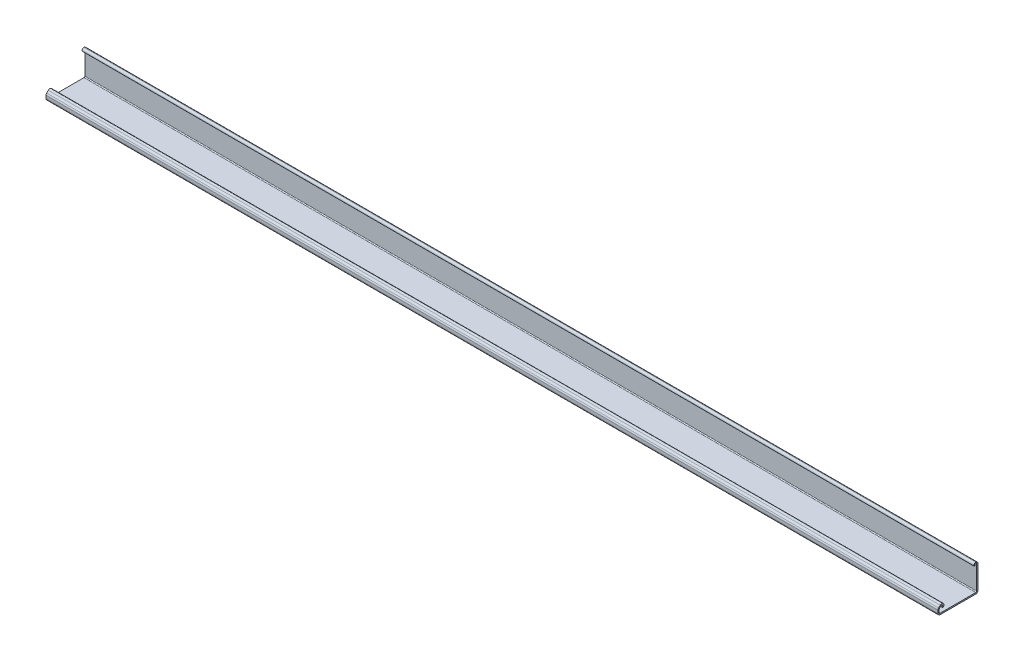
ISO-10303-21;
HEADER;
FILE_DESCRIPTION(('STEP AP214'),'2;1');
FILE_NAME('part.step','',(''),(''),'','','');
FILE_SCHEMA(('AUTOMOTIVE_DESIGN { 1 0 10303 214 1 1 1 1 }'));
ENDSEC;
DATA;
#1=APPLICATION_CONTEXT('core data for automotive mechanical design processes');
#2=APPLICATION_PROTOCOL_DEFINITION('international standard','automotive_design',2000,#1);
#3=PRODUCT_CONTEXT('',#1,'mechanical');
#4=PRODUCT('Part','Part','',(#3));
#5=PRODUCT_RELATED_PRODUCT_CATEGORY('part','',(#4));
#6=PRODUCT_DEFINITION_FORMATION('','',#4);
#7=PRODUCT_DEFINITION_CONTEXT('part definition',#1,'design');
#8=PRODUCT_DEFINITION('design','',#6,#7);
#9=PRODUCT_DEFINITION_SHAPE('','',#8);
#10=(LENGTH_UNIT() NAMED_UNIT(*) SI_UNIT(.MILLI.,.METRE.));
#11=(NAMED_UNIT(*) PLANE_ANGLE_UNIT() SI_UNIT($,.RADIAN.));
#12=(NAMED_UNIT(*) SI_UNIT($,.STERADIAN.) SOLID_ANGLE_UNIT());
#13=UNCERTAINTY_MEASURE_WITH_UNIT(LENGTH_MEASURE(1.E-05),#10,'distance_accuracy_value','');
#14=(GEOMETRIC_REPRESENTATION_CONTEXT(3) GLOBAL_UNCERTAINTY_ASSIGNED_CONTEXT((#13)) GLOBAL_UNIT_ASSIGNED_CONTEXT((#10,
#11,#12)) REPRESENTATION_CONTEXT('',''));
#15=CARTESIAN_POINT('',(0.,0.,0.));
#16=DIRECTION('',(0.,0.,1.));
#17=DIRECTION('',(1.,0.,0.));
#18=AXIS2_PLACEMENT_3D('',#15,#16,#17);
#19=CARTESIAN_POINT('',(1000.,-7.87278591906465,18.19962667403));
#20=DIRECTION('',(-1.,0.,0.));
#21=DIRECTION('',(0.,0.,1.));
#22=AXIS2_PLACEMENT_3D('',#19,#20,#21);
#23=CYLINDRICAL_SURFACE('',#22,2.50000101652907);
#24=CARTESIAN_POINT('',(0.,-7.87278591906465,18.19962667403));
#25=DIRECTION('',(1.,0.,0.));
#26=DIRECTION('',(0.,0.,-1.));
#27=AXIS2_PLACEMENT_3D('',#24,#25,#26);
#28=CIRCLE('',#27,2.50000101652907);
#29=CARTESIAN_POINT('',(0.,-9.64055404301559,16.431859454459));
#30=VERTEX_POINT('',#29);
#31=CARTESIAN_POINT('',(0.,-6.10501779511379,19.9673938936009));
#32=VERTEX_POINT('',#31);
#33=EDGE_CURVE('E211',#30,#32,#28,.T.);
#34=ORIENTED_EDGE('',*,*,#33,.T.);
#35=DIRECTION('',(-1.,0.,0.));
#36=VECTOR('',#35,1.);
#37=CARTESIAN_POINT('',(1000.,-6.10501779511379,19.9673938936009));
#38=LINE('',#37,#36);
#39=CARTESIAN_POINT('',(1000.,-6.10501779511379,19.9673938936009));
#40=VERTEX_POINT('',#39);
#41=EDGE_CURVE('E12',#40,#32,#38,.T.);
#42=ORIENTED_EDGE('',*,*,#41,.F.);
#43=CARTESIAN_POINT('',(1000.,-7.87278591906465,18.19962667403));
#44=DIRECTION('',(1.,0.,0.));
#45=DIRECTION('',(0.,0.,-1.));
#46=AXIS2_PLACEMENT_3D('',#43,#44,#45);
#47=CIRCLE('',#46,2.50000101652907);
#48=CARTESIAN_POINT('',(1000.,-9.64055404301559,16.431859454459));
#49=VERTEX_POINT('',#48);
#50=EDGE_CURVE('E217',#49,#40,#47,.T.);
#51=ORIENTED_EDGE('',*,*,#50,.F.);
#52=DIRECTION('',(-1.,0.,0.));
#53=VECTOR('',#52,1.);
#54=CARTESIAN_POINT('',(1000.,-9.64055404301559,16.431859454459));
#55=LINE('',#54,#53);
#56=EDGE_CURVE('E291',#49,#30,#55,.T.);
#57=ORIENTED_EDGE('',*,*,#56,.T.);
#58=EDGE_LOOP('',(#34,#42,#51,#57));
#59=FACE_BOUND('',#58,.T.);
#60=ADVANCED_FACE('F121',(#59),#23,.T.);
#61=CARTESIAN_POINT('',(1000.,-6.10501779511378,19.9673938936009));
#62=DIRECTION('',(0.,-0.707107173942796,-0.707106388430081));
#63=DIRECTION('',(0.,0.707106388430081,-0.707107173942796));
#64=AXIS2_PLACEMENT_3D('',#61,#62,#63);
#65=PLANE('',#64);
#66=DIRECTION('',(0.,-0.707106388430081,0.707107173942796));
#67=VECTOR('',#66,1.);
#68=CARTESIAN_POINT('',(0.,-6.10501779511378,19.9673938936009));
#69=LINE('',#68,#67);
#70=CARTESIAN_POINT('',(0.,-7.90538787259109,21.7677659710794));
#71=VERTEX_POINT('',#70);
#72=EDGE_CURVE('E296',#32,#71,#69,.T.);
#73=ORIENTED_EDGE('',*,*,#72,.T.);
#74=DIRECTION('',(-1.,0.,0.));
#75=VECTOR('',#74,1.);
#76=CARTESIAN_POINT('',(1000.,-7.90538787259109,21.7677659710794));
#77=LINE('',#76,#75);
#78=CARTESIAN_POINT('',(1000.,-7.90538787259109,21.7677659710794));
#79=VERTEX_POINT('',#78);
#80=EDGE_CURVE('E129',#79,#71,#77,.T.);
#81=ORIENTED_EDGE('',*,*,#80,.F.);
#82=DIRECTION('',(0.,-0.707106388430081,0.707107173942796));
#83=VECTOR('',#82,1.);
#84=CARTESIAN_POINT('',(1000.,-6.10501779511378,19.9673938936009));
#85=LINE('',#84,#83);
#86=EDGE_CURVE('E448',#40,#79,#85,.T.);
#87=ORIENTED_EDGE('',*,*,#86,.F.);
#88=ORIENTED_EDGE('',*,*,#41,.T.);
#89=EDGE_LOOP('',(#73,#81,#87,#88));
#90=FACE_BOUND('',#89,.T.);
#91=ADVANCED_FACE('F451',(#90),#65,.F.);
#92=CARTESIAN_POINT('',(1000.,-9.67315580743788,20.0000000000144));
#93=DIRECTION('',(-1.,0.,0.));
#94=DIRECTION('',(0.,0.,1.));
#95=AXIS2_PLACEMENT_3D('',#92,#93,#94);
#96=CYLINDRICAL_SURFACE('',#95,2.49999999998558);
#97=CARTESIAN_POINT('',(0.,-9.67315580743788,20.0000000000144));
#98=DIRECTION('',(1.,0.,0.));
#99=DIRECTION('',(0.,0.,-1.));
#100=AXIS2_PLACEMENT_3D('',#97,#98,#99);
#101=CIRCLE('',#100,2.49999999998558);
#102=CARTESIAN_POINT('',(0.,-9.67315580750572,22.5));
#103=VERTEX_POINT('',#102);
#104=EDGE_CURVE('E298',#71,#103,#101,.T.);
#105=ORIENTED_EDGE('',*,*,#104,.T.);
#106=DIRECTION('',(-1.,0.,0.));
#107=VECTOR('',#106,1.);
#108=CARTESIAN_POINT('',(1000.,-9.67315580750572,22.5));
#109=LINE('',#108,#107);
#110=CARTESIAN_POINT('',(1000.,-9.67315580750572,22.5));
#111=VERTEX_POINT('',#110);
#112=EDGE_CURVE('E381',#111,#103,#109,.T.);
#113=ORIENTED_EDGE('',*,*,#112,.F.);
#114=CARTESIAN_POINT('',(1000.,-9.67315580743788,20.0000000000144));
#115=DIRECTION('',(1.,0.,0.));
#116=DIRECTION('',(0.,0.,-1.));
#117=AXIS2_PLACEMENT_3D('',#114,#115,#116);
#118=CIRCLE('',#117,2.49999999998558);
#119=EDGE_CURVE('E390',#79,#111,#118,.T.);
#120=ORIENTED_EDGE('',*,*,#119,.F.);
#121=ORIENTED_EDGE('',*,*,#80,.T.);
#122=EDGE_LOOP('',(#105,#113,#120,#121));
#123=FACE_BOUND('',#122,.T.);
#124=ADVANCED_FACE('F388',(#123),#96,.T.);
#125=CARTESIAN_POINT('',(1000.,-9.67315580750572,22.5));
#126=DIRECTION('',(0.,0.,-1.));
#127=DIRECTION('',(0.,1.,0.));
#128=AXIS2_PLACEMENT_3D('',#125,#126,#127);
#129=PLANE('',#128);
#130=DIRECTION('',(0.,-1.,0.));
#131=VECTOR('',#130,1.);
#132=CARTESIAN_POINT('',(0.,-9.67315580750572,22.5));
#133=LINE('',#132,#131);
#134=CARTESIAN_POINT('',(0.,-12.8727848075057,22.5));
#135=VERTEX_POINT('',#134);
#136=EDGE_CURVE('E300',#103,#135,#133,.T.);
#137=ORIENTED_EDGE('',*,*,#136,.T.);
#138=DIRECTION('',(-1.,0.,0.));
#139=VECTOR('',#138,1.);
#140=CARTESIAN_POINT('',(1000.,-12.8727848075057,22.5));
#141=LINE('',#140,#139);
#142=CARTESIAN_POINT('',(1000.,-12.8727848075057,22.5));
#143=VERTEX_POINT('',#142);
#144=EDGE_CURVE('E378',#143,#135,#141,.T.);
#145=ORIENTED_EDGE('',*,*,#144,.F.);
#146=DIRECTION('',(0.,-1.,0.));
#147=VECTOR('',#146,1.);
#148=CARTESIAN_POINT('',(1000.,-9.67315580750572,22.5));
#149=LINE('',#148,#147);
#150=EDGE_CURVE('E408',#111,#143,#149,.T.);
#151=ORIENTED_EDGE('',*,*,#150,.F.);
#152=ORIENTED_EDGE('',*,*,#112,.T.);
#153=EDGE_LOOP('',(#137,#145,#151,#152));
#154=FACE_BOUND('',#153,.T.);
#155=ADVANCED_FACE('F399',(#154),#129,.F.);
#156=CARTESIAN_POINT('',(1000.,-12.8727848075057,20.));
#157=DIRECTION('',(-1.,0.,0.));
#158=DIRECTION('',(0.,0.,1.));
#159=AXIS2_PLACEMENT_3D('',#156,#157,#158);
#160=CYLINDRICAL_SURFACE('',#159,2.5);
#161=CARTESIAN_POINT('',(0.,-12.8727848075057,20.));
#162=DIRECTION('',(1.,0.,0.));
#163=DIRECTION('',(0.,0.,-1.));
#164=AXIS2_PLACEMENT_3D('',#161,#162,#163);
#165=CIRCLE('',#164,2.5);
#166=CARTESIAN_POINT('',(0.,-15.3727848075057,20.));
#167=VERTEX_POINT('',#166);
#168=EDGE_CURVE('E302',#135,#167,#165,.T.);
#169=ORIENTED_EDGE('',*,*,#168,.T.);
#170=DIRECTION('',(-1.,0.,0.));
#171=VECTOR('',#170,1.);
#172=CARTESIAN_POINT('',(1000.,-15.3727848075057,20.));
#173=LINE('',#172,#171);
#174=CARTESIAN_POINT('',(1000.,-15.3727848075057,20.));
#175=VERTEX_POINT('',#174);
#176=EDGE_CURVE('E375',#175,#167,#173,.T.);
#177=ORIENTED_EDGE('',*,*,#176,.F.);
#178=CARTESIAN_POINT('',(1000.,-12.8727848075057,20.));
#179=DIRECTION('',(1.,0.,0.));
#180=DIRECTION('',(0.,0.,-1.));
#181=AXIS2_PLACEMENT_3D('',#178,#179,#180);
#182=CIRCLE('',#181,2.5);
#183=EDGE_CURVE('E405',#143,#175,#182,.T.);
#184=ORIENTED_EDGE('',*,*,#183,.F.);
#185=ORIENTED_EDGE('',*,*,#144,.T.);
#186=EDGE_LOOP('',(#169,#177,#184,#185));
#187=FACE_BOUND('',#186,.T.);
#188=ADVANCED_FACE('F403',(#187),#160,.T.);
#189=CARTESIAN_POINT('',(1000.,-15.3727848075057,20.));
#190=DIRECTION('',(0.,1.,0.));
#191=DIRECTION('',(0.,0.,1.));
#192=AXIS2_PLACEMENT_3D('',#189,#190,#191);
#193=PLANE('',#192);
#194=DIRECTION('',(0.,0.,-1.));
#195=VECTOR('',#194,1.);
#196=CARTESIAN_POINT('',(0.,-15.3727848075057,20.));
#197=LINE('',#196,#195);
#198=CARTESIAN_POINT('',(0.,-15.3727848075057,-20.));
#199=VERTEX_POINT('',#198);
#200=EDGE_CURVE('E304',#167,#199,#197,.T.);
#201=ORIENTED_EDGE('',*,*,#200,.T.);
#202=DIRECTION('',(-1.,0.,0.));
#203=VECTOR('',#202,1.);
#204=CARTESIAN_POINT('',(1000.,-15.3727848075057,-20.));
#205=LINE('',#204,#203);
#206=CARTESIAN_POINT('',(1000.,-15.3727848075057,-20.));
#207=VERTEX_POINT('',#206);
#208=EDGE_CURVE('E372',#207,#199,#205,.T.);
#209=ORIENTED_EDGE('',*,*,#208,.F.);
#210=DIRECTION('',(0.,0.,-1.));
#211=VECTOR('',#210,1.);
#212=CARTESIAN_POINT('',(1000.,-15.3727848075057,20.));
#213=LINE('',#212,#211);
#214=EDGE_CURVE('E407',#175,#207,#213,.T.);
#215=ORIENTED_EDGE('',*,*,#214,.F.);
#216=ORIENTED_EDGE('',*,*,#176,.T.);
#217=EDGE_LOOP('',(#201,#209,#215,#216));
#218=FACE_BOUND('',#217,.T.);
#219=ADVANCED_FACE('F463',(#218),#193,.F.);
#220=CARTESIAN_POINT('',(1000.,-12.8727848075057,-20.));
#221=DIRECTION('',(-1.,0.,0.));
#222=DIRECTION('',(0.,0.,1.));
#223=AXIS2_PLACEMENT_3D('',#220,#221,#222);
#224=CYLINDRICAL_SURFACE('',#223,2.5);
#225=CARTESIAN_POINT('',(0.,-12.8727848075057,-20.));
#226=DIRECTION('',(1.,0.,0.));
#227=DIRECTION('',(0.,0.,-1.));
#228=AXIS2_PLACEMENT_3D('',#225,#226,#227);
#229=CIRCLE('',#228,2.5);
#230=CARTESIAN_POINT('',(0.,-12.8727848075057,-22.5));
#231=VERTEX_POINT('',#230);
#232=EDGE_CURVE('E306',#199,#231,#229,.T.);
#233=ORIENTED_EDGE('',*,*,#232,.T.);
#234=DIRECTION('',(-1.,0.,0.));
#235=VECTOR('',#234,1.);
#236=CARTESIAN_POINT('',(1000.,-12.8727848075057,-22.5));
#237=LINE('',#236,#235);
#238=CARTESIAN_POINT('',(1000.,-12.8727848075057,-22.5));
#239=VERTEX_POINT('',#238);
#240=EDGE_CURVE('E369',#239,#231,#237,.T.);
#241=ORIENTED_EDGE('',*,*,#240,.F.);
#242=CARTESIAN_POINT('',(1000.,-12.8727848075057,-20.));
#243=DIRECTION('',(1.,0.,0.));
#244=DIRECTION('',(0.,0.,-1.));
#245=AXIS2_PLACEMENT_3D('',#242,#243,#244);
#246=CIRCLE('',#245,2.5);
#247=EDGE_CURVE('E410',#207,#239,#246,.T.);
#248=ORIENTED_EDGE('',*,*,#247,.F.);
#249=ORIENTED_EDGE('',*,*,#208,.T.);
#250=EDGE_LOOP('',(#233,#241,#248,#249));
#251=FACE_BOUND('',#250,.T.);
#252=ADVANCED_FACE('F466',(#251),#224,.T.);
#253=CARTESIAN_POINT('',(1000.,-12.8727848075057,-22.5));
#254=DIRECTION('',(0.,0.,1.));
#255=DIRECTION('',(1.,0.,0.));
#256=AXIS2_PLACEMENT_3D('',#253,#254,#255);
#257=PLANE('',#256);
#258=DIRECTION('',(0.,1.,0.));
#259=VECTOR('',#258,1.);
#260=CARTESIAN_POINT('',(0.,-12.8727848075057,-22.5));
#261=LINE('',#260,#259);
#262=CARTESIAN_POINT('',(0.,13.1272151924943,-22.5));
#263=VERTEX_POINT('',#262);
#264=EDGE_CURVE('E308',#231,#263,#261,.T.);
#265=ORIENTED_EDGE('',*,*,#264,.T.);
#266=DIRECTION('',(-1.,0.,0.));
#267=VECTOR('',#266,1.);
#268=CARTESIAN_POINT('',(1000.,13.1272151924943,-22.5));
#269=LINE('',#268,#267);
#270=CARTESIAN_POINT('',(1000.,13.1272151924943,-22.5));
#271=VERTEX_POINT('',#270);
#272=EDGE_CURVE('E366',#271,#263,#269,.T.);
#273=ORIENTED_EDGE('',*,*,#272,.F.);
#274=DIRECTION('',(0.,1.,0.));
#275=VECTOR('',#274,1.);
#276=CARTESIAN_POINT('',(1000.,-12.8727848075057,-22.5));
#277=LINE('',#276,#275);
#278=EDGE_CURVE('E416',#239,#271,#277,.T.);
#279=ORIENTED_EDGE('',*,*,#278,.F.);
#280=ORIENTED_EDGE('',*,*,#240,.T.);
#281=EDGE_LOOP('',(#265,#273,#279,#280));
#282=FACE_BOUND('',#281,.T.);
#283=ADVANCED_FACE('F470',(#282),#257,.F.);
#284=CARTESIAN_POINT('',(1000.,13.1272151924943,-20.));
#285=DIRECTION('',(-1.,0.,0.));
#286=DIRECTION('',(0.,0.,1.));
#287=AXIS2_PLACEMENT_3D('',#284,#285,#286);
#288=CYLINDRICAL_SURFACE('',#287,2.5);
#289=CARTESIAN_POINT('',(0.,13.1272151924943,-20.));
#290=DIRECTION('',(1.,0.,0.));
#291=DIRECTION('',(0.,0.,-1.));
#292=AXIS2_PLACEMENT_3D('',#289,#290,#291);
#293=CIRCLE('',#292,2.5);
#294=CARTESIAN_POINT('',(0.,15.6272151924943,-20.));
#295=VERTEX_POINT('',#294);
#296=EDGE_CURVE('E310',#263,#295,#293,.T.);
#297=ORIENTED_EDGE('',*,*,#296,.T.);
#298=DIRECTION('',(-1.,0.,0.));
#299=VECTOR('',#298,1.);
#300=CARTESIAN_POINT('',(1000.,15.6272151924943,-20.));
#301=LINE('',#300,#299);
#302=CARTESIAN_POINT('',(1000.,15.6272151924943,-20.));
#303=VERTEX_POINT('',#302);
#304=EDGE_CURVE('E363',#303,#295,#301,.T.);
#305=ORIENTED_EDGE('',*,*,#304,.F.);
#306=CARTESIAN_POINT('',(1000.,13.1272151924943,-20.));
#307=DIRECTION('',(1.,0.,0.));
#308=DIRECTION('',(0.,0.,-1.));
#309=AXIS2_PLACEMENT_3D('',#306,#307,#308);
#310=CIRCLE('',#309,2.5);
#311=EDGE_CURVE('E418',#271,#303,#310,.T.);
#312=ORIENTED_EDGE('',*,*,#311,.F.);
#313=ORIENTED_EDGE('',*,*,#272,.T.);
#314=EDGE_LOOP('',(#297,#305,#312,#313));
#315=FACE_BOUND('',#314,.T.);
#316=ADVANCED_FACE('F474',(#315),#288,.T.);
#317=CARTESIAN_POINT('',(1000.,13.6272151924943,-20.0000006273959));
#318=DIRECTION('',(-1.,0.,0.));
#319=DIRECTION('',(0.,0.,1.));
#320=AXIS2_PLACEMENT_3D('',#317,#318,#319);
#321=CYLINDRICAL_SURFACE('',#320,2.00000000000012);
#322=CARTESIAN_POINT('',(0.,13.6272151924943,-20.0000006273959));
#323=DIRECTION('',(1.,0.,0.));
#324=DIRECTION('',(0.,0.,-1.));
#325=AXIS2_PLACEMENT_3D('',#322,#323,#324);
#326=CIRCLE('',#325,2.00000000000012);
#327=CARTESIAN_POINT('',(0.,12.6526001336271,-18.253539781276));
#328=VERTEX_POINT('',#327);
#329=EDGE_CURVE('E312',#295,#328,#326,.T.);
#330=ORIENTED_EDGE('',*,*,#329,.T.);
#331=DIRECTION('',(-1.,0.,0.));
#332=VECTOR('',#331,1.);
#333=CARTESIAN_POINT('',(1000.,12.6526001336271,-18.253539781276));
#334=LINE('',#333,#332);
#335=CARTESIAN_POINT('',(1000.,12.6526001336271,-18.253539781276));
#336=VERTEX_POINT('',#335);
#337=EDGE_CURVE('E360',#336,#328,#334,.T.);
#338=ORIENTED_EDGE('',*,*,#337,.F.);
#339=CARTESIAN_POINT('',(1000.,13.6272151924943,-20.0000006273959));
#340=DIRECTION('',(1.,0.,0.));
#341=DIRECTION('',(0.,0.,-1.));
#342=AXIS2_PLACEMENT_3D('',#339,#340,#341);
#343=CIRCLE('',#342,2.00000000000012);
#344=EDGE_CURVE('E420',#303,#336,#343,.T.);
#345=ORIENTED_EDGE('',*,*,#344,.F.);
#346=ORIENTED_EDGE('',*,*,#304,.T.);
#347=EDGE_LOOP('',(#330,#338,#345,#346));
#348=FACE_BOUND('',#347,.T.);
#349=ADVANCED_FACE('F478',(#348),#321,.T.);
#350=CARTESIAN_POINT('',(1000.,12.8962544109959,-18.6901550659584));
#351=DIRECTION('',(-1.,0.,0.));
#352=DIRECTION('',(0.,0.,1.));
#353=AXIS2_PLACEMENT_3D('',#350,#351,#352);
#354=CYLINDRICAL_SURFACE('',#353,0.500000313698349);
#355=CARTESIAN_POINT('',(0.,12.8962544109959,-18.6901550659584));
#356=DIRECTION('',(1.,0.,0.));
#357=DIRECTION('',(0.,0.,-1.));
#358=AXIS2_PLACEMENT_3D('',#355,#356,#357);
#359=CIRCLE('',#358,0.500000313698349);
#360=CARTESIAN_POINT('',(0.,13.1399086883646,-19.1267703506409));
#361=VERTEX_POINT('',#360);
#362=EDGE_CURVE('E314',#328,#361,#359,.T.);
#363=ORIENTED_EDGE('',*,*,#362,.T.);
#364=DIRECTION('',(-1.,0.,0.));
#365=VECTOR('',#364,1.);
#366=CARTESIAN_POINT('',(1000.,13.1399086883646,-19.1267703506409));
#367=LINE('',#366,#365);
#368=CARTESIAN_POINT('',(1000.,13.1399086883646,-19.1267703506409));
#369=VERTEX_POINT('',#368);
#370=EDGE_CURVE('E357',#369,#361,#367,.T.);
#371=ORIENTED_EDGE('',*,*,#370,.F.);
#372=CARTESIAN_POINT('',(1000.,12.8962544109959,-18.6901550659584));
#373=DIRECTION('',(1.,0.,0.));
#374=DIRECTION('',(0.,0.,-1.));
#375=AXIS2_PLACEMENT_3D('',#372,#373,#374);
#376=CIRCLE('',#375,0.500000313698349);
#377=EDGE_CURVE('E422',#336,#369,#376,.T.);
#378=ORIENTED_EDGE('',*,*,#377,.F.);
#379=ORIENTED_EDGE('',*,*,#337,.T.);
#380=EDGE_LOOP('',(#363,#371,#378,#379));
#381=FACE_BOUND('',#380,.T.);
#382=ADVANCED_FACE('F482',(#381),#354,.T.);
#383=CARTESIAN_POINT('',(1000.,13.6272151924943,-20.0000006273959));
#384=DIRECTION('',(-1.,0.,0.));
#385=DIRECTION('',(0.,0.,1.));
#386=AXIS2_PLACEMENT_3D('',#383,#384,#385);
#387=CYLINDRICAL_SURFACE('',#386,0.99999937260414);
#388=CARTESIAN_POINT('',(0.,13.6272151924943,-20.0000006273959));
#389=DIRECTION('',(-1.,0.,0.));
#390=DIRECTION('',(0.,0.,-1.));
#391=AXIS2_PLACEMENT_3D('',#388,#389,#390);
#392=CIRCLE('',#391,0.99999937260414);
#393=CARTESIAN_POINT('',(0.,13.6272151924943,-21.));
#394=VERTEX_POINT('',#393);
#395=EDGE_CURVE('E317',#361,#394,#392,.T.);
#396=ORIENTED_EDGE('',*,*,#395,.T.);
#397=DIRECTION('',(-1.,0.,0.));
#398=VECTOR('',#397,1.);
#399=CARTESIAN_POINT('',(1000.,13.6272151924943,-21.));
#400=LINE('',#399,#398);
#401=CARTESIAN_POINT('',(1000.,13.6272151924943,-21.));
#402=VERTEX_POINT('',#401);
#403=EDGE_CURVE('E354',#402,#394,#400,.T.);
#404=ORIENTED_EDGE('',*,*,#403,.F.);
#405=CARTESIAN_POINT('',(1000.,13.6272151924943,-20.0000006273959));
#406=DIRECTION('',(-1.,0.,0.));
#407=DIRECTION('',(0.,0.,-1.));
#408=AXIS2_PLACEMENT_3D('',#405,#406,#407);
#409=CIRCLE('',#408,0.999999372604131);
#410=EDGE_CURVE('E424',#369,#402,#409,.T.);
#411=ORIENTED_EDGE('',*,*,#410,.F.);
#412=ORIENTED_EDGE('',*,*,#370,.T.);
#413=EDGE_LOOP('',(#396,#404,#411,#412));
#414=FACE_BOUND('',#413,.T.);
#415=ADVANCED_FACE('F486',(#414),#387,.F.);
#416=CARTESIAN_POINT('',(1000.,13.6272151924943,-21.));
#417=DIRECTION('',(0.,0.,-1.));
#418=DIRECTION('',(0.,1.,0.));
#419=AXIS2_PLACEMENT_3D('',#416,#417,#418);
#420=PLANE('',#419);
#421=DIRECTION('',(0.,-1.,0.));
#422=VECTOR('',#421,1.);
#423=CARTESIAN_POINT('',(0.,13.6272151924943,-21.));
#424=LINE('',#423,#422);
#425=CARTESIAN_POINT('',(0.,-12.8727848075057,-21.));
#426=VERTEX_POINT('',#425);
#427=EDGE_CURVE('E319',#394,#426,#424,.T.);
#428=ORIENTED_EDGE('',*,*,#427,.T.);
#429=DIRECTION('',(-1.,0.,0.));
#430=VECTOR('',#429,1.);
#431=CARTESIAN_POINT('',(1000.,-12.8727848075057,-21.));
#432=LINE('',#431,#430);
#433=CARTESIAN_POINT('',(1000.,-12.8727848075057,-21.));
#434=VERTEX_POINT('',#433);
#435=EDGE_CURVE('E351',#434,#426,#432,.T.);
#436=ORIENTED_EDGE('',*,*,#435,.F.);
#437=DIRECTION('',(0.,-1.,0.));
#438=VECTOR('',#437,1.);
#439=CARTESIAN_POINT('',(1000.,13.6272151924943,-21.));
#440=LINE('',#439,#438);
#441=EDGE_CURVE('E426',#402,#434,#440,.T.);
#442=ORIENTED_EDGE('',*,*,#441,.F.);
#443=ORIENTED_EDGE('',*,*,#403,.T.);
#444=EDGE_LOOP('',(#428,#436,#442,#443));
#445=FACE_BOUND('',#444,.T.);
#446=ADVANCED_FACE('F490',(#445),#420,.F.);
#447=CARTESIAN_POINT('',(1000.,-12.8727848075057,-20.));
#448=DIRECTION('',(-1.,0.,0.));
#449=DIRECTION('',(0.,0.,1.));
#450=AXIS2_PLACEMENT_3D('',#447,#448,#449);
#451=CYLINDRICAL_SURFACE('',#450,0.999999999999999);
#452=CARTESIAN_POINT('',(0.,-12.8727848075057,-20.));
#453=DIRECTION('',(-1.,0.,0.));
#454=DIRECTION('',(0.,0.,-1.));
#455=AXIS2_PLACEMENT_3D('',#452,#453,#454);
#456=CIRCLE('',#455,0.999999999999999);
#457=CARTESIAN_POINT('',(0.,-13.8727848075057,-20.));
#458=VERTEX_POINT('',#457);
#459=EDGE_CURVE('E321',#426,#458,#456,.T.);
#460=ORIENTED_EDGE('',*,*,#459,.T.);
#461=DIRECTION('',(-1.,0.,0.));
#462=VECTOR('',#461,1.);
#463=CARTESIAN_POINT('',(1000.,-13.8727848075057,-20.));
#464=LINE('',#463,#462);
#465=CARTESIAN_POINT('',(1000.,-13.8727848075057,-20.));
#466=VERTEX_POINT('',#465);
#467=EDGE_CURVE('E348',#466,#458,#464,.T.);
#468=ORIENTED_EDGE('',*,*,#467,.F.);
#469=CARTESIAN_POINT('',(1000.,-12.8727848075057,-20.));
#470=DIRECTION('',(-1.,0.,0.));
#471=DIRECTION('',(0.,0.,-1.));
#472=AXIS2_PLACEMENT_3D('',#469,#470,#471);
#473=CIRCLE('',#472,0.999999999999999);
#474=EDGE_CURVE('E428',#434,#466,#473,.T.);
#475=ORIENTED_EDGE('',*,*,#474,.F.);
#476=ORIENTED_EDGE('',*,*,#435,.T.);
#477=EDGE_LOOP('',(#460,#468,#475,#476));
#478=FACE_BOUND('',#477,.T.);
#479=ADVANCED_FACE('F494',(#478),#451,.F.);
#480=CARTESIAN_POINT('',(1000.,-13.8727848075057,-20.));
#481=DIRECTION('',(0.,-1.,0.));
#482=DIRECTION('',(0.,0.,-1.));
#483=AXIS2_PLACEMENT_3D('',#480,#481,#482);
#484=PLANE('',#483);
#485=DIRECTION('',(0.,0.,1.));
#486=VECTOR('',#485,1.);
#487=CARTESIAN_POINT('',(0.,-13.8727848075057,-20.));
#488=LINE('',#487,#486);
#489=CARTESIAN_POINT('',(0.,-13.8727848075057,20.));
#490=VERTEX_POINT('',#489);
#491=EDGE_CURVE('E323',#458,#490,#488,.T.);
#492=ORIENTED_EDGE('',*,*,#491,.T.);
#493=DIRECTION('',(-1.,0.,0.));
#494=VECTOR('',#493,1.);
#495=CARTESIAN_POINT('',(1000.,-13.8727848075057,20.));
#496=LINE('',#495,#494);
#497=CARTESIAN_POINT('',(1000.,-13.8727848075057,20.));
#498=VERTEX_POINT('',#497);
#499=EDGE_CURVE('E345',#498,#490,#496,.T.);
#500=ORIENTED_EDGE('',*,*,#499,.F.);
#501=DIRECTION('',(0.,0.,1.));
#502=VECTOR('',#501,1.);
#503=CARTESIAN_POINT('',(1000.,-13.8727848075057,-20.));
#504=LINE('',#503,#502);
#505=EDGE_CURVE('E430',#466,#498,#504,.T.);
#506=ORIENTED_EDGE('',*,*,#505,.F.);
#507=ORIENTED_EDGE('',*,*,#467,.T.);
#508=EDGE_LOOP('',(#492,#500,#506,#507));
#509=FACE_BOUND('',#508,.T.);
#510=ADVANCED_FACE('F498',(#509),#484,.F.);
#511=CARTESIAN_POINT('',(1000.,-12.8727848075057,20.));
#512=DIRECTION('',(-1.,0.,0.));
#513=DIRECTION('',(0.,0.,1.));
#514=AXIS2_PLACEMENT_3D('',#511,#512,#513);
#515=CYLINDRICAL_SURFACE('',#514,0.999999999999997);
#516=CARTESIAN_POINT('',(0.,-12.8727848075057,20.));
#517=DIRECTION('',(-1.,0.,0.));
#518=DIRECTION('',(0.,0.,-1.));
#519=AXIS2_PLACEMENT_3D('',#516,#517,#518);
#520=CIRCLE('',#519,0.999999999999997);
#521=CARTESIAN_POINT('',(0.,-12.8727848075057,21.));
#522=VERTEX_POINT('',#521);
#523=EDGE_CURVE('E325',#490,#522,#520,.T.);
#524=ORIENTED_EDGE('',*,*,#523,.T.);
#525=DIRECTION('',(-1.,0.,0.));
#526=VECTOR('',#525,1.);
#527=CARTESIAN_POINT('',(1000.,-12.8727848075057,21.));
#528=LINE('',#527,#526);
#529=CARTESIAN_POINT('',(1000.,-12.8727848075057,21.));
#530=VERTEX_POINT('',#529);
#531=EDGE_CURVE('E342',#530,#522,#528,.T.);
#532=ORIENTED_EDGE('',*,*,#531,.F.);
#533=CARTESIAN_POINT('',(1000.,-12.8727848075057,20.));
#534=DIRECTION('',(-1.,0.,0.));
#535=DIRECTION('',(0.,0.,-1.));
#536=AXIS2_PLACEMENT_3D('',#533,#534,#535);
#537=CIRCLE('',#536,0.999999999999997);
#538=EDGE_CURVE('E432',#498,#530,#537,.T.);
#539=ORIENTED_EDGE('',*,*,#538,.F.);
#540=ORIENTED_EDGE('',*,*,#499,.T.);
#541=EDGE_LOOP('',(#524,#532,#539,#540));
#542=FACE_BOUND('',#541,.T.);
#543=ADVANCED_FACE('F502',(#542),#515,.F.);
#544=CARTESIAN_POINT('',(1000.,-12.8727848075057,21.));
#545=DIRECTION('',(0.,0.,1.));
#546=DIRECTION('',(1.,0.,0.));
#547=AXIS2_PLACEMENT_3D('',#544,#545,#546);
#548=PLANE('',#547);
#549=DIRECTION('',(0.,1.,0.));
#550=VECTOR('',#549,1.);
#551=CARTESIAN_POINT('',(0.,-12.8727848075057,21.));
#552=LINE('',#551,#550);
#553=CARTESIAN_POINT('',(0.,-9.67315580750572,21.));
#554=VERTEX_POINT('',#553);
#555=EDGE_CURVE('E327',#522,#554,#552,.T.);
#556=ORIENTED_EDGE('',*,*,#555,.T.);
#557=DIRECTION('',(-1.,0.,0.));
#558=VECTOR('',#557,1.);
#559=CARTESIAN_POINT('',(1000.,-9.67315580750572,21.));
#560=LINE('',#559,#558);
#561=CARTESIAN_POINT('',(1000.,-9.67315580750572,21.));
#562=VERTEX_POINT('',#561);
#563=EDGE_CURVE('E339',#562,#554,#560,.T.);
#564=ORIENTED_EDGE('',*,*,#563,.F.);
#565=DIRECTION('',(0.,1.,0.));
#566=VECTOR('',#565,1.);
#567=CARTESIAN_POINT('',(1000.,-12.8727848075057,21.));
#568=LINE('',#567,#566);
#569=EDGE_CURVE('E434',#530,#562,#568,.T.);
#570=ORIENTED_EDGE('',*,*,#569,.F.);
#571=ORIENTED_EDGE('',*,*,#531,.T.);
#572=EDGE_LOOP('',(#556,#564,#570,#571));
#573=FACE_BOUND('',#572,.T.);
#574=ADVANCED_FACE('F440',(#573),#548,.F.);
#575=CARTESIAN_POINT('',(1000.,-9.67315580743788,20.0000000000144));
#576=DIRECTION('',(-1.,0.,0.));
#577=DIRECTION('',(0.,0.,1.));
#578=AXIS2_PLACEMENT_3D('',#575,#576,#577);
#579=CYLINDRICAL_SURFACE('',#578,0.999999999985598);
#580=CARTESIAN_POINT('',(0.,-9.67315580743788,20.0000000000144));
#581=DIRECTION('',(-1.,0.,0.));
#582=DIRECTION('',(0.,0.,-1.));
#583=AXIS2_PLACEMENT_3D('',#580,#581,#582);
#584=CIRCLE('',#583,0.999999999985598);
#585=CARTESIAN_POINT('',(0.,-8.96604843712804,20.7071061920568));
#586=VERTEX_POINT('',#585);
#587=EDGE_CURVE('E329',#554,#586,#584,.T.);
#588=ORIENTED_EDGE('',*,*,#587,.T.);
#589=DIRECTION('',(-1.,0.,0.));
#590=VECTOR('',#589,1.);
#591=CARTESIAN_POINT('',(1000.,-8.96604843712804,20.7071061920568));
#592=LINE('',#591,#590);
#593=CARTESIAN_POINT('',(1000.,-8.96604843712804,20.7071061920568));
#594=VERTEX_POINT('',#593);
#595=EDGE_CURVE('E286',#594,#586,#592,.T.);
#596=ORIENTED_EDGE('',*,*,#595,.F.);
#597=CARTESIAN_POINT('',(1000.,-9.67315580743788,20.0000000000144));
#598=DIRECTION('',(-1.,0.,0.));
#599=DIRECTION('',(0.,0.,-1.));
#600=AXIS2_PLACEMENT_3D('',#597,#598,#599);
#601=CIRCLE('',#600,0.999999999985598);
#602=EDGE_CURVE('E276',#562,#594,#601,.T.);
#603=ORIENTED_EDGE('',*,*,#602,.F.);
#604=ORIENTED_EDGE('',*,*,#563,.T.);
#605=EDGE_LOOP('',(#588,#596,#603,#604));
#606=FACE_BOUND('',#605,.T.);
#607=ADVANCED_FACE('F444',(#606),#579,.F.);
#608=CARTESIAN_POINT('',(1000.,-8.96604843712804,20.7071061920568));
#609=DIRECTION('',(0.,0.707107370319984,0.70710619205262));
#610=DIRECTION('',(0.,-0.70710619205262,0.707107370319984));
#611=AXIS2_PLACEMENT_3D('',#608,#609,#610);
#612=PLANE('',#611);
#613=DIRECTION('',(0.,0.70710619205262,-0.707107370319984));
#614=VECTOR('',#613,1.);
#615=CARTESIAN_POINT('',(0.,-8.96604843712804,20.7071061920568));
#616=LINE('',#615,#614);
#617=CARTESIAN_POINT('',(0.,-7.16567885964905,18.9067336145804));
#618=VERTEX_POINT('',#617);
#619=EDGE_CURVE('E285',#586,#618,#616,.T.);
#620=ORIENTED_EDGE('',*,*,#619,.T.);
#621=DIRECTION('',(-1.,0.,0.));
#622=VECTOR('',#621,1.);
#623=CARTESIAN_POINT('',(1000.,-7.16567885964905,18.9067336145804));
#624=LINE('',#623,#622);
#625=CARTESIAN_POINT('',(1000.,-7.16567885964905,18.9067336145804));
#626=VERTEX_POINT('',#625);
#627=EDGE_CURVE('E282',#626,#618,#624,.T.);
#628=ORIENTED_EDGE('',*,*,#627,.F.);
#629=DIRECTION('',(0.,0.70710619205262,-0.707107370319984));
#630=VECTOR('',#629,1.);
#631=CARTESIAN_POINT('',(1000.,-8.96604843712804,20.7071061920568));
#632=LINE('',#631,#630);
#633=EDGE_CURVE('E270',#594,#626,#632,.T.);
#634=ORIENTED_EDGE('',*,*,#633,.F.);
#635=ORIENTED_EDGE('',*,*,#595,.T.);
#636=EDGE_LOOP('',(#620,#628,#634,#635));
#637=FACE_BOUND('',#636,.T.);
#638=ADVANCED_FACE('F283',(#637),#612,.F.);
#639=CARTESIAN_POINT('',(1000.,-7.87278591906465,18.19962667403));
#640=DIRECTION('',(-1.,0.,0.));
#641=DIRECTION('',(0.,0.,1.));
#642=AXIS2_PLACEMENT_3D('',#639,#640,#641);
#643=CYLINDRICAL_SURFACE('',#642,1.00000030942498);
#644=CARTESIAN_POINT('',(0.,-7.87278591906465,18.19962667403));
#645=DIRECTION('',(-1.,0.,0.));
#646=DIRECTION('',(0.,0.,-1.));
#647=AXIS2_PLACEMENT_3D('',#644,#645,#646);
#648=CIRCLE('',#647,1.00000030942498);
#649=CARTESIAN_POINT('',(0.,-8.57989357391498,17.4925203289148));
#650=VERTEX_POINT('',#649);
#651=EDGE_CURVE('E204',#618,#650,#648,.T.);
#652=ORIENTED_EDGE('',*,*,#651,.T.);
#653=DIRECTION('',(-1.,0.,0.));
#654=VECTOR('',#653,1.);
#655=CARTESIAN_POINT('',(1000.,-8.57989357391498,17.4925203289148));
#656=LINE('',#655,#654);
#657=CARTESIAN_POINT('',(1000.,-8.57989357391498,17.4925203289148));
#658=VERTEX_POINT('',#657);
#659=EDGE_CURVE('E287',#658,#650,#656,.T.);
#660=ORIENTED_EDGE('',*,*,#659,.F.);
#661=CARTESIAN_POINT('',(1000.,-7.87278591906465,18.19962667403));
#662=DIRECTION('',(-1.,0.,0.));
#663=DIRECTION('',(0.,0.,-1.));
#664=AXIS2_PLACEMENT_3D('',#661,#662,#663);
#665=CIRCLE('',#664,1.00000030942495);
#666=EDGE_CURVE('E274',#626,#658,#665,.T.);
#667=ORIENTED_EDGE('',*,*,#666,.F.);
#668=ORIENTED_EDGE('',*,*,#627,.T.);
#669=EDGE_LOOP('',(#652,#660,#667,#668));
#670=FACE_BOUND('',#669,.T.);
#671=ADVANCED_FACE('F289',(#670),#643,.F.);
#672=CARTESIAN_POINT('',(1000.,-9.1102238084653,16.9621898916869));
#673=DIRECTION('',(-1.,0.,0.));
#674=DIRECTION('',(0.,0.,1.));
#675=AXIS2_PLACEMENT_3D('',#672,#673,#674);
#676=CYLINDRICAL_SURFACE('',#675,0.750000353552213);
#677=CARTESIAN_POINT('',(0.,-9.1102238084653,16.9621898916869));
#678=DIRECTION('',(1.,0.,0.));
#679=DIRECTION('',(0.,0.,-1.));
#680=AXIS2_PLACEMENT_3D('',#677,#678,#679);
#681=CIRCLE('',#680,0.750000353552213);
#682=EDGE_CURVE('E333',#650,#30,#681,.T.);
#683=ORIENTED_EDGE('',*,*,#682,.T.);
#684=ORIENTED_EDGE('',*,*,#56,.F.);
#685=CARTESIAN_POINT('',(1000.,-9.1102238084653,16.9621898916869));
#686=DIRECTION('',(1.,0.,0.));
#687=DIRECTION('',(0.,0.,-1.));
#688=AXIS2_PLACEMENT_3D('',#685,#686,#687);
#689=CIRCLE('',#688,0.750000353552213);
#690=EDGE_CURVE('E137',#658,#49,#689,.T.);
#691=ORIENTED_EDGE('',*,*,#690,.F.);
#692=ORIENTED_EDGE('',*,*,#659,.T.);
#693=EDGE_LOOP('',(#683,#684,#691,#692));
#694=FACE_BOUND('',#693,.T.);
#695=ADVANCED_FACE('F446',(#694),#676,.T.);
#696=CARTESIAN_POINT('',(1000.,-7.87278591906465,18.19962667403));
#697=DIRECTION('',(1.,0.,0.));
#698=DIRECTION('',(0.,0.,-1.));
#699=AXIS2_PLACEMENT_3D('',#696,#697,#698);
#700=PLANE('',#699);
#701=ORIENTED_EDGE('',*,*,#50,.T.);
#702=ORIENTED_EDGE('',*,*,#86,.T.);
#703=ORIENTED_EDGE('',*,*,#119,.T.);
#704=ORIENTED_EDGE('',*,*,#150,.T.);
#705=ORIENTED_EDGE('',*,*,#183,.T.);
#706=ORIENTED_EDGE('',*,*,#214,.T.);
#707=ORIENTED_EDGE('',*,*,#247,.T.);
#708=ORIENTED_EDGE('',*,*,#278,.T.);
#709=ORIENTED_EDGE('',*,*,#311,.T.);
#710=ORIENTED_EDGE('',*,*,#344,.T.);
#711=ORIENTED_EDGE('',*,*,#377,.T.);
#712=ORIENTED_EDGE('',*,*,#410,.T.);
#713=ORIENTED_EDGE('',*,*,#441,.T.);
#714=ORIENTED_EDGE('',*,*,#474,.T.);
#715=ORIENTED_EDGE('',*,*,#505,.T.);
#716=ORIENTED_EDGE('',*,*,#538,.T.);
#717=ORIENTED_EDGE('',*,*,#569,.T.);
#718=ORIENTED_EDGE('',*,*,#602,.T.);
#719=ORIENTED_EDGE('',*,*,#633,.T.);
#720=ORIENTED_EDGE('',*,*,#666,.T.);
#721=ORIENTED_EDGE('',*,*,#690,.T.);
#722=EDGE_LOOP('',(#701,#702,#703,#704,#705,#706,#707,#708,#709,#710,#711,#712,#713,#714,#715,
#716,#717,#718,#719,#720,#721));
#723=FACE_BOUND('',#722,.T.);
#724=ADVANCED_FACE('F272',(#723),#700,.T.);
#725=CARTESIAN_POINT('',(0.,-7.87278591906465,18.19962667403));
#726=DIRECTION('',(1.,0.,0.));
#727=DIRECTION('',(0.,0.,-1.));
#728=AXIS2_PLACEMENT_3D('',#725,#726,#727);
#729=PLANE('',#728);
#730=ORIENTED_EDGE('',*,*,#33,.F.);
#731=ORIENTED_EDGE('',*,*,#682,.F.);
#732=ORIENTED_EDGE('',*,*,#651,.F.);
#733=ORIENTED_EDGE('',*,*,#619,.F.);
#734=ORIENTED_EDGE('',*,*,#587,.F.);
#735=ORIENTED_EDGE('',*,*,#555,.F.);
#736=ORIENTED_EDGE('',*,*,#523,.F.);
#737=ORIENTED_EDGE('',*,*,#491,.F.);
#738=ORIENTED_EDGE('',*,*,#459,.F.);
#739=ORIENTED_EDGE('',*,*,#427,.F.);
#740=ORIENTED_EDGE('',*,*,#395,.F.);
#741=ORIENTED_EDGE('',*,*,#362,.F.);
#742=ORIENTED_EDGE('',*,*,#329,.F.);
#743=ORIENTED_EDGE('',*,*,#296,.F.);
#744=ORIENTED_EDGE('',*,*,#264,.F.);
#745=ORIENTED_EDGE('',*,*,#232,.F.);
#746=ORIENTED_EDGE('',*,*,#200,.F.);
#747=ORIENTED_EDGE('',*,*,#168,.F.);
#748=ORIENTED_EDGE('',*,*,#136,.F.);
#749=ORIENTED_EDGE('',*,*,#104,.F.);
#750=ORIENTED_EDGE('',*,*,#72,.F.);
#751=EDGE_LOOP('',(#730,#731,#732,#733,#734,#735,#736,#737,#738,#739,#740,#741,#742,#743,#744,
#745,#746,#747,#748,#749,#750));
#752=FACE_BOUND('',#751,.T.);
#753=ADVANCED_FACE('F394',(#752),#729,.F.);
#754=CLOSED_SHELL('',(#60,#91,#124,#155,#188,#219,#252,#283,#316,#349,#382,#415,#446,#479,#510,
#543,#574,#607,#638,#671,#695,#724,#753));
#755=MANIFOLD_SOLID_BREP('B2',#754);
#756=ADVANCED_BREP_SHAPE_REPRESENTATION('',(#18,#755),#14);
#757=SHAPE_DEFINITION_REPRESENTATION(#9,#756);
ENDSEC;
END-ISO-10303-21;
